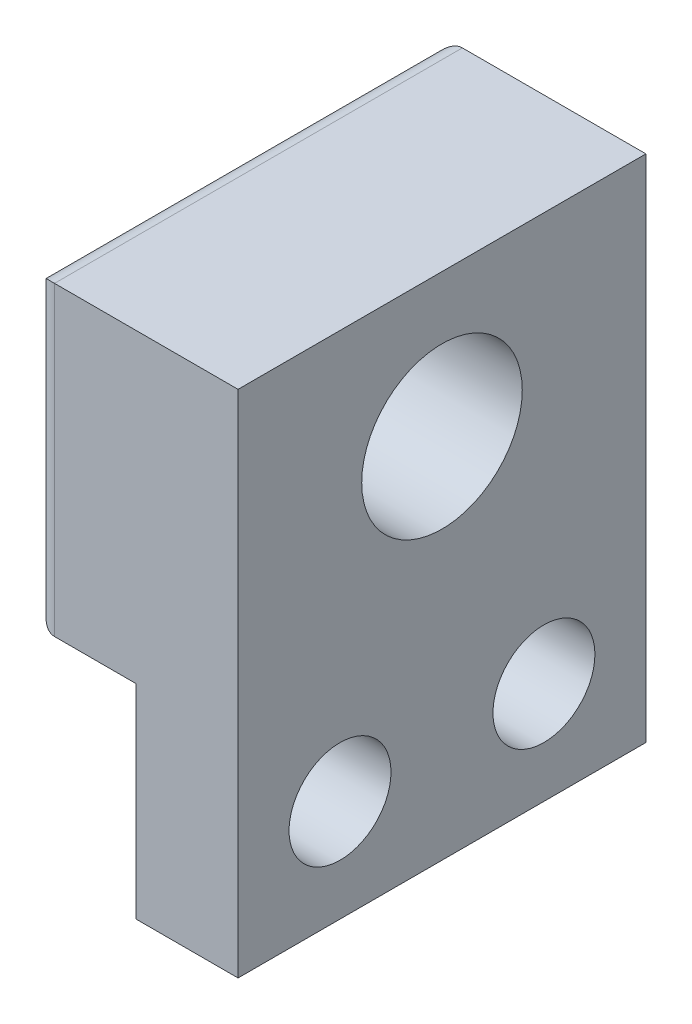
from build123d import *

# Parameters (mm, degrees)
SKETCH1_W           = 12.7
SKETCH1_H           = 19.05
SKETCH1_W_2         = 6.35
SKETCH1_H_2         = 12.7
BOSS_EXTRUDE1_DEPTH = 25.4
SKETCH2_R           = 5
SKETCH2_R_2         = 3.175
CUT_EXTRUDE1_DEPTH  = 35.195796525
FILLET1_R           = 1.27


with BuildPart() as part:
    # Sketch1 → Boss-Extrude1 (new body)
    with BuildSketch(Plane.XY):
        with Locations((-6.35, 9.525)):
            Rectangle(SKETCH1_W, SKETCH1_H)
        with Locations((-3.175, -6.35)):
            Rectangle(SKETCH1_W_2, SKETCH1_H_2)
    extrude(amount=-BOSS_EXTRUDE1_DEPTH)

    # Sketch2 → Cut-Extrude1 (cut, through all)
    with BuildSketch(Plane(origin=(0, 0, 0), x_dir=(0, 0, -1), z_dir=(1, 0, 0))):
        with Locations((12.7, 10.16)):
            Circle(SKETCH2_R)
        with Locations((6.35, -6.35)):
            Circle(SKETCH2_R_2)
        with Locations((19.05, -6.35)):
            Circle(SKETCH2_R_2)
    extrude(amount=-CUT_EXTRUDE1_DEPTH, mode=Mode.SUBTRACT)

    # Fillet1
    fillet1_edges = [part.edges().sort_by_distance(p)[0] for p in [
        (-12.7, 9.525, 0),
        (-12.7, 19.05, -12.7),
        (-12.7, 0, -12.7),
        (-12.7, 9.525, -25.4),
    ]]
    fillet(fillet1_edges, radius=FILLET1_R)


solid = part.part
